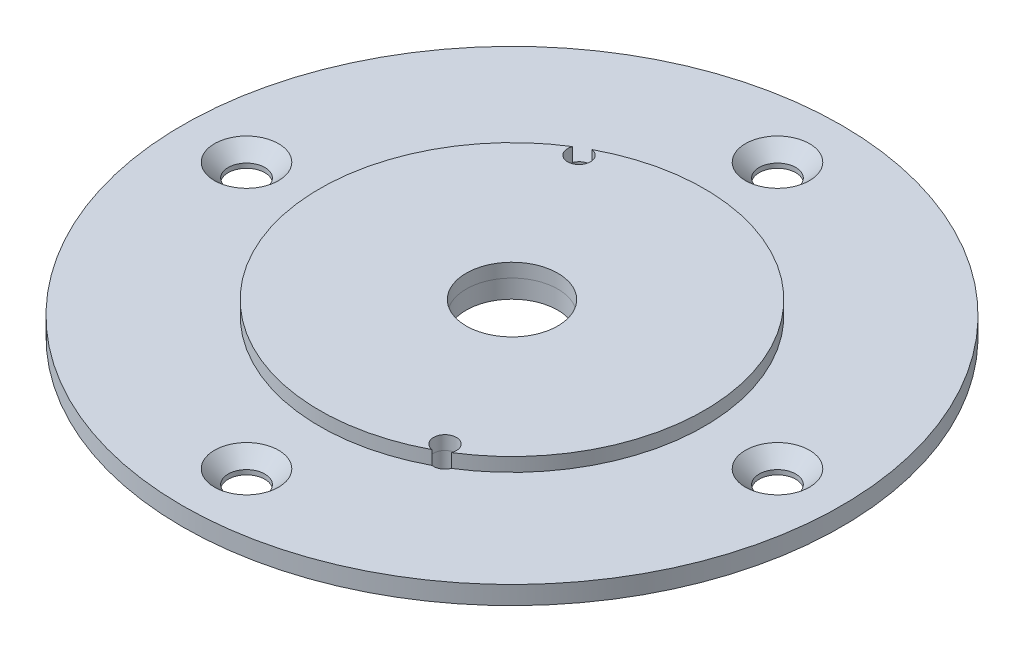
ISO-10303-21;
HEADER;
FILE_DESCRIPTION(('STEP AP214'),'2;1');
FILE_NAME('part.step','',(''),(''),'','','');
FILE_SCHEMA(('AUTOMOTIVE_DESIGN { 1 0 10303 214 1 1 1 1 }'));
ENDSEC;
DATA;
#1=APPLICATION_CONTEXT('core data for automotive mechanical design processes');
#2=APPLICATION_PROTOCOL_DEFINITION('international standard','automotive_design',2000,#1);
#3=PRODUCT_CONTEXT('',#1,'mechanical');
#4=PRODUCT('Part','Part','',(#3));
#5=PRODUCT_RELATED_PRODUCT_CATEGORY('part','',(#4));
#6=PRODUCT_DEFINITION_FORMATION('','',#4);
#7=PRODUCT_DEFINITION_CONTEXT('part definition',#1,'design');
#8=PRODUCT_DEFINITION('design','',#6,#7);
#9=PRODUCT_DEFINITION_SHAPE('','',#8);
#10=(LENGTH_UNIT() NAMED_UNIT(*) SI_UNIT(.MILLI.,.METRE.));
#11=(NAMED_UNIT(*) PLANE_ANGLE_UNIT() SI_UNIT($,.RADIAN.));
#12=(NAMED_UNIT(*) SI_UNIT($,.STERADIAN.) SOLID_ANGLE_UNIT());
#13=UNCERTAINTY_MEASURE_WITH_UNIT(LENGTH_MEASURE(1.E-05),#10,'distance_accuracy_value','');
#14=(GEOMETRIC_REPRESENTATION_CONTEXT(3) GLOBAL_UNCERTAINTY_ASSIGNED_CONTEXT((#13)) GLOBAL_UNIT_ASSIGNED_CONTEXT((#10,
#11,#12)) REPRESENTATION_CONTEXT('',''));
#15=CARTESIAN_POINT('',(0.,0.,0.));
#16=DIRECTION('',(0.,0.,1.));
#17=DIRECTION('',(1.,0.,0.));
#18=AXIS2_PLACEMENT_3D('',#15,#16,#17);
#19=CARTESIAN_POINT('',(4.99999999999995,2.5,8.66025403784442));
#20=DIRECTION('',(0.,1.,0.));
#21=DIRECTION('',(0.,0.,1.));
#22=AXIS2_PLACEMENT_3D('',#19,#20,#21);
#23=PLANE('',#22);
#24=CARTESIAN_POINT('',(9.99999999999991,2.5,17.3205080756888));
#25=DIRECTION('',(0.,-1.,0.));
#26=DIRECTION('',(0.,0.,1.));
#27=AXIS2_PLACEMENT_3D('',#24,#25,#26);
#28=CIRCLE('',#27,1.24999999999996);
#29=CARTESIAN_POINT('',(9.8275212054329,2.5,18.5585513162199));
#30=VERTEX_POINT('',#29);
#31=CARTESIAN_POINT('',(11.1584162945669,2.5,17.7901586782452));
#32=VERTEX_POINT('',#31);
#33=EDGE_CURVE('E103',#30,#32,#28,.T.);
#34=ORIENTED_EDGE('',*,*,#33,.T.);
#35=CARTESIAN_POINT('',(0.,2.5,0.));
#36=DIRECTION('',(0.,1.,0.));
#37=DIRECTION('',(0.,0.,1.));
#38=AXIS2_PLACEMENT_3D('',#35,#36,#37);
#39=CIRCLE('',#38,21.);
#40=CARTESIAN_POINT('',(-9.82752120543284,2.5,-18.5585513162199));
#41=VERTEX_POINT('',#40);
#42=EDGE_CURVE('E98',#32,#41,#39,.T.);
#43=ORIENTED_EDGE('',*,*,#42,.T.);
#44=CARTESIAN_POINT('',(-9.9999999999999,2.5,-17.3205080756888));
#45=DIRECTION('',(0.,-1.,0.));
#46=DIRECTION('',(0.,0.,1.));
#47=AXIS2_PLACEMENT_3D('',#44,#45,#46);
#48=CIRCLE('',#47,1.25);
#49=CARTESIAN_POINT('',(-11.1584162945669,2.5,-17.7901586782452));
#50=VERTEX_POINT('',#49);
#51=EDGE_CURVE('E101',#41,#50,#48,.T.);
#52=ORIENTED_EDGE('',*,*,#51,.T.);
#53=CARTESIAN_POINT('',(0.,2.5,0.));
#54=DIRECTION('',(0.,1.,0.));
#55=DIRECTION('',(0.,0.,1.));
#56=AXIS2_PLACEMENT_3D('',#53,#54,#55);
#57=CIRCLE('',#56,21.);
#58=EDGE_CURVE('E68',#50,#30,#57,.T.);
#59=ORIENTED_EDGE('',*,*,#58,.T.);
#60=EDGE_LOOP('',(#34,#43,#52,#59));
#61=FACE_BOUND('',#60,.T.);
#62=CARTESIAN_POINT('',(0.,2.5,0.));
#63=DIRECTION('',(0.,1.,0.));
#64=DIRECTION('',(0.,0.,1.));
#65=AXIS2_PLACEMENT_3D('',#62,#63,#64);
#66=CIRCLE('',#65,5.);
#67=CARTESIAN_POINT('',(0.,2.5,5.));
#68=VERTEX_POINT('',#67);
#69=EDGE_CURVE('E118',#68,#68,#66,.T.);
#70=ORIENTED_EDGE('',*,*,#69,.F.);
#71=EDGE_LOOP('',(#70));
#72=FACE_BOUND('',#71,.T.);
#73=ADVANCED_FACE('F51',(#61,#72),#23,.T.);
#74=CARTESIAN_POINT('',(4.99999999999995,1.,8.66025403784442));
#75=DIRECTION('',(0.,1.,0.));
#76=DIRECTION('',(0.,0.,1.));
#77=AXIS2_PLACEMENT_3D('',#74,#75,#76);
#78=PLANE('',#77);
#79=CARTESIAN_POINT('',(9.99999999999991,1.,17.3205080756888));
#80=DIRECTION('',(0.,-1.,0.));
#81=DIRECTION('',(0.,0.,1.));
#82=AXIS2_PLACEMENT_3D('',#79,#80,#81);
#83=CIRCLE('',#82,1.24999999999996);
#84=CARTESIAN_POINT('',(9.8275212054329,1.,18.5585513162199));
#85=VERTEX_POINT('',#84);
#86=CARTESIAN_POINT('',(11.1584162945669,1.,17.7901586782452));
#87=VERTEX_POINT('',#86);
#88=EDGE_CURVE('E115',#85,#87,#83,.T.);
#89=ORIENTED_EDGE('',*,*,#88,.F.);
#90=CARTESIAN_POINT('',(0.,1.,0.));
#91=DIRECTION('',(0.,1.,0.));
#92=DIRECTION('',(0.,0.,1.));
#93=AXIS2_PLACEMENT_3D('',#90,#91,#92);
#94=CIRCLE('',#93,21.);
#95=CARTESIAN_POINT('',(-11.1584162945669,1.,-17.7901586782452));
#96=VERTEX_POINT('',#95);
#97=EDGE_CURVE('E91',#96,#85,#94,.T.);
#98=ORIENTED_EDGE('',*,*,#97,.F.);
#99=CARTESIAN_POINT('',(-9.9999999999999,1.,-17.3205080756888));
#100=DIRECTION('',(0.,-1.,0.));
#101=DIRECTION('',(0.,0.,1.));
#102=AXIS2_PLACEMENT_3D('',#99,#100,#101);
#103=CIRCLE('',#102,1.25);
#104=CARTESIAN_POINT('',(-9.82752120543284,1.,-18.5585513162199));
#105=VERTEX_POINT('',#104);
#106=EDGE_CURVE('E85',#105,#96,#103,.T.);
#107=ORIENTED_EDGE('',*,*,#106,.F.);
#108=CARTESIAN_POINT('',(0.,1.,0.));
#109=DIRECTION('',(0.,1.,0.));
#110=DIRECTION('',(0.,0.,1.));
#111=AXIS2_PLACEMENT_3D('',#108,#109,#110);
#112=CIRCLE('',#111,21.);
#113=EDGE_CURVE('E107',#87,#105,#112,.T.);
#114=ORIENTED_EDGE('',*,*,#113,.F.);
#115=EDGE_LOOP('',(#89,#98,#107,#114));
#116=FACE_BOUND('',#115,.T.);
#117=CARTESIAN_POINT('',(0.,1.,0.));
#118=DIRECTION('',(0.,1.,0.));
#119=DIRECTION('',(0.,0.,1.));
#120=AXIS2_PLACEMENT_3D('',#117,#118,#119);
#121=CIRCLE('',#120,5.);
#122=CARTESIAN_POINT('',(0.,1.,5.));
#123=VERTEX_POINT('',#122);
#124=EDGE_CURVE('E130',#123,#123,#121,.T.);
#125=ORIENTED_EDGE('',*,*,#124,.T.);
#126=EDGE_LOOP('',(#125));
#127=FACE_BOUND('',#126,.T.);
#128=ADVANCED_FACE('F126',(#116,#127),#78,.F.);
#129=CARTESIAN_POINT('',(9.99999999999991,2.5,17.3205080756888));
#130=DIRECTION('',(0.,-1.,0.));
#131=DIRECTION('',(0.,0.,-1.));
#132=AXIS2_PLACEMENT_3D('',#129,#130,#131);
#133=CYLINDRICAL_SURFACE('',#132,1.24999999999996);
#134=ORIENTED_EDGE('',*,*,#88,.T.);
#135=DIRECTION('',(0.,-1.,0.));
#136=VECTOR('',#135,1.);
#137=CARTESIAN_POINT('',(11.1584162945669,2.5,17.7901586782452));
#138=LINE('',#137,#136);
#139=EDGE_CURVE('E12',#32,#87,#138,.T.);
#140=ORIENTED_EDGE('',*,*,#139,.F.);
#141=ORIENTED_EDGE('',*,*,#33,.F.);
#142=DIRECTION('',(0.,-1.,0.));
#143=VECTOR('',#142,1.);
#144=CARTESIAN_POINT('',(9.8275212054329,2.5,18.5585513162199));
#145=LINE('',#144,#143);
#146=EDGE_CURVE('E111',#30,#85,#145,.T.);
#147=ORIENTED_EDGE('',*,*,#146,.T.);
#148=EDGE_LOOP('',(#134,#140,#141,#147));
#149=FACE_BOUND('',#148,.T.);
#150=ADVANCED_FACE('F53',(#149),#133,.F.);
#151=CARTESIAN_POINT('',(0.,2.5,0.));
#152=DIRECTION('',(0.,-1.,0.));
#153=DIRECTION('',(0.,0.,-1.));
#154=AXIS2_PLACEMENT_3D('',#151,#152,#153);
#155=CYLINDRICAL_SURFACE('',#154,21.);
#156=ORIENTED_EDGE('',*,*,#113,.T.);
#157=DIRECTION('',(0.,-1.,0.));
#158=VECTOR('',#157,1.);
#159=CARTESIAN_POINT('',(-9.82752120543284,2.5,-18.5585513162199));
#160=LINE('',#159,#158);
#161=EDGE_CURVE('E60',#41,#105,#160,.T.);
#162=ORIENTED_EDGE('',*,*,#161,.F.);
#163=ORIENTED_EDGE('',*,*,#42,.F.);
#164=ORIENTED_EDGE('',*,*,#139,.T.);
#165=EDGE_LOOP('',(#156,#162,#163,#164));
#166=FACE_BOUND('',#165,.T.);
#167=ADVANCED_FACE('F106',(#166),#155,.T.);
#168=CARTESIAN_POINT('',(-9.9999999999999,2.5,-17.3205080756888));
#169=DIRECTION('',(0.,-1.,0.));
#170=DIRECTION('',(0.,0.,-1.));
#171=AXIS2_PLACEMENT_3D('',#168,#169,#170);
#172=CYLINDRICAL_SURFACE('',#171,1.25);
#173=ORIENTED_EDGE('',*,*,#106,.T.);
#174=DIRECTION('',(0.,-1.,0.));
#175=VECTOR('',#174,1.);
#176=CARTESIAN_POINT('',(-11.1584162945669,2.5,-17.7901586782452));
#177=LINE('',#176,#175);
#178=EDGE_CURVE('E108',#50,#96,#177,.T.);
#179=ORIENTED_EDGE('',*,*,#178,.F.);
#180=ORIENTED_EDGE('',*,*,#51,.F.);
#181=ORIENTED_EDGE('',*,*,#161,.T.);
#182=EDGE_LOOP('',(#173,#179,#180,#181));
#183=FACE_BOUND('',#182,.T.);
#184=ADVANCED_FACE('F109',(#183),#172,.F.);
#185=CARTESIAN_POINT('',(0.,2.5,0.));
#186=DIRECTION('',(0.,-1.,0.));
#187=DIRECTION('',(0.,0.,-1.));
#188=AXIS2_PLACEMENT_3D('',#185,#186,#187);
#189=CYLINDRICAL_SURFACE('',#188,21.);
#190=ORIENTED_EDGE('',*,*,#97,.T.);
#191=ORIENTED_EDGE('',*,*,#146,.F.);
#192=ORIENTED_EDGE('',*,*,#58,.F.);
#193=ORIENTED_EDGE('',*,*,#178,.T.);
#194=EDGE_LOOP('',(#190,#191,#192,#193));
#195=FACE_BOUND('',#194,.T.);
#196=ADVANCED_FACE('F123',(#195),#189,.T.);
#197=CARTESIAN_POINT('',(0.,2.5,0.));
#198=DIRECTION('',(0.,-1.,0.));
#199=DIRECTION('',(0.,0.,-1.));
#200=AXIS2_PLACEMENT_3D('',#197,#198,#199);
#201=CYLINDRICAL_SURFACE('',#200,5.);
#202=ORIENTED_EDGE('',*,*,#69,.T.);
#203=EDGE_LOOP('',(#202));
#204=FACE_BOUND('',#203,.T.);
#205=ORIENTED_EDGE('',*,*,#124,.F.);
#206=EDGE_LOOP('',(#205));
#207=FACE_BOUND('',#206,.T.);
#208=ADVANCED_FACE('F136',(#204,#207),#201,.F.);
#209=CLOSED_SHELL('',(#73,#128,#150,#167,#184,#196,#208));
#210=MANIFOLD_SOLID_BREP('B2',#209);
#211=CARTESIAN_POINT('',(0.,1.,0.));
#212=DIRECTION('',(0.,1.,0.));
#213=DIRECTION('',(0.,0.,1.));
#214=AXIS2_PLACEMENT_3D('',#211,#212,#213);
#215=PLANE('',#214);
#216=CARTESIAN_POINT('',(-9.9999999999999,1.,-17.3205080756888));
#217=DIRECTION('',(0.,1.,0.));
#218=DIRECTION('',(0.,0.,1.));
#219=AXIS2_PLACEMENT_3D('',#216,#217,#218);
#220=CIRCLE('',#219,1.25);
#221=CARTESIAN_POINT('',(-9.9999999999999,1.,-16.0705080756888));
#222=VERTEX_POINT('',#221);
#223=EDGE_CURVE('E275',#222,#222,#220,.T.);
#224=ORIENTED_EDGE('',*,*,#223,.F.);
#225=EDGE_LOOP('',(#224));
#226=FACE_BOUND('',#225,.T.);
#227=CARTESIAN_POINT('',(9.99999999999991,1.,17.3205080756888));
#228=DIRECTION('',(0.,1.,0.));
#229=DIRECTION('',(0.,0.,1.));
#230=AXIS2_PLACEMENT_3D('',#227,#228,#229);
#231=CIRCLE('',#230,1.25);
#232=CARTESIAN_POINT('',(9.99999999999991,1.,18.5705080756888));
#233=VERTEX_POINT('',#232);
#234=EDGE_CURVE('E269',#233,#233,#231,.T.);
#235=ORIENTED_EDGE('',*,*,#234,.F.);
#236=EDGE_LOOP('',(#235));
#237=FACE_BOUND('',#236,.T.);
#238=CARTESIAN_POINT('',(-29.,1.,0.));
#239=DIRECTION('',(0.,1.,0.));
#240=DIRECTION('',(0.,0.,1.));
#241=AXIS2_PLACEMENT_3D('',#238,#239,#240);
#242=CIRCLE('',#241,3.5);
#243=CARTESIAN_POINT('',(-29.,1.,3.5));
#244=VERTEX_POINT('',#243);
#245=EDGE_CURVE('E263',#244,#244,#242,.T.);
#246=ORIENTED_EDGE('',*,*,#245,.F.);
#247=EDGE_LOOP('',(#246));
#248=FACE_BOUND('',#247,.T.);
#249=CARTESIAN_POINT('',(29.,1.,0.));
#250=DIRECTION('',(0.,1.,0.));
#251=DIRECTION('',(0.,0.,1.));
#252=AXIS2_PLACEMENT_3D('',#249,#250,#251);
#253=CIRCLE('',#252,3.5);
#254=CARTESIAN_POINT('',(29.,1.,3.5));
#255=VERTEX_POINT('',#254);
#256=EDGE_CURVE('E254',#255,#255,#253,.T.);
#257=ORIENTED_EDGE('',*,*,#256,.F.);
#258=EDGE_LOOP('',(#257));
#259=FACE_BOUND('',#258,.T.);
#260=CARTESIAN_POINT('',(0.,1.,-29.));
#261=DIRECTION('',(0.,1.,0.));
#262=DIRECTION('',(0.,0.,1.));
#263=AXIS2_PLACEMENT_3D('',#260,#261,#262);
#264=CIRCLE('',#263,3.5);
#265=CARTESIAN_POINT('',(0.,1.,-25.5));
#266=VERTEX_POINT('',#265);
#267=EDGE_CURVE('E245',#266,#266,#264,.T.);
#268=ORIENTED_EDGE('',*,*,#267,.F.);
#269=EDGE_LOOP('',(#268));
#270=FACE_BOUND('',#269,.T.);
#271=CARTESIAN_POINT('',(0.,1.,29.));
#272=DIRECTION('',(0.,1.,0.));
#273=DIRECTION('',(0.,0.,1.));
#274=AXIS2_PLACEMENT_3D('',#271,#272,#273);
#275=CIRCLE('',#274,3.5);
#276=CARTESIAN_POINT('',(0.,1.,32.5));
#277=VERTEX_POINT('',#276);
#278=EDGE_CURVE('E236',#277,#277,#275,.T.);
#279=ORIENTED_EDGE('',*,*,#278,.F.);
#280=EDGE_LOOP('',(#279));
#281=FACE_BOUND('',#280,.T.);
#282=CARTESIAN_POINT('',(0.,1.,0.));
#283=DIRECTION('',(0.,1.,0.));
#284=DIRECTION('',(0.,0.,1.));
#285=AXIS2_PLACEMENT_3D('',#282,#283,#284);
#286=CIRCLE('',#285,36.);
#287=CARTESIAN_POINT('',(0.,1.,36.));
#288=VERTEX_POINT('',#287);
#289=EDGE_CURVE('E50',#288,#288,#286,.T.);
#290=ORIENTED_EDGE('',*,*,#289,.T.);
#291=EDGE_LOOP('',(#290));
#292=FACE_BOUND('',#291,.T.);
#293=CARTESIAN_POINT('',(0.,1.,0.));
#294=DIRECTION('',(0.,1.,0.));
#295=DIRECTION('',(0.,0.,1.));
#296=AXIS2_PLACEMENT_3D('',#293,#294,#295);
#297=CIRCLE('',#296,5.);
#298=CARTESIAN_POINT('',(0.,1.,5.));
#299=VERTEX_POINT('',#298);
#300=EDGE_CURVE('E223',#299,#299,#297,.T.);
#301=ORIENTED_EDGE('',*,*,#300,.F.);
#302=EDGE_LOOP('',(#301));
#303=FACE_BOUND('',#302,.T.);
#304=ADVANCED_FACE('F212',(#226,#237,#248,#259,#270,#281,#292,#303),#215,.T.);
#305=CARTESIAN_POINT('',(0.,-1.,0.));
#306=DIRECTION('',(0.,1.,0.));
#307=DIRECTION('',(0.,0.,1.));
#308=AXIS2_PLACEMENT_3D('',#305,#306,#307);
#309=PLANE('',#308);
#310=CARTESIAN_POINT('',(-9.9999999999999,-1.,-17.3205080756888));
#311=DIRECTION('',(0.,1.,0.));
#312=DIRECTION('',(0.,0.,1.));
#313=AXIS2_PLACEMENT_3D('',#310,#311,#312);
#314=CIRCLE('',#313,1.25);
#315=CARTESIAN_POINT('',(-9.9999999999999,-1.,-16.0705080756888));
#316=VERTEX_POINT('',#315);
#317=EDGE_CURVE('E272',#316,#316,#314,.T.);
#318=ORIENTED_EDGE('',*,*,#317,.T.);
#319=EDGE_LOOP('',(#318));
#320=FACE_BOUND('',#319,.T.);
#321=CARTESIAN_POINT('',(9.99999999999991,-1.,17.3205080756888));
#322=DIRECTION('',(0.,1.,0.));
#323=DIRECTION('',(0.,0.,1.));
#324=AXIS2_PLACEMENT_3D('',#321,#322,#323);
#325=CIRCLE('',#324,1.25);
#326=CARTESIAN_POINT('',(9.99999999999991,-1.,18.5705080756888));
#327=VERTEX_POINT('',#326);
#328=EDGE_CURVE('E266',#327,#327,#325,.T.);
#329=ORIENTED_EDGE('',*,*,#328,.T.);
#330=EDGE_LOOP('',(#329));
#331=FACE_BOUND('',#330,.T.);
#332=CARTESIAN_POINT('',(-29.,-1.,0.));
#333=DIRECTION('',(0.,1.,0.));
#334=DIRECTION('',(0.,0.,1.));
#335=AXIS2_PLACEMENT_3D('',#332,#333,#334);
#336=CIRCLE('',#335,2.);
#337=CARTESIAN_POINT('',(-29.,-1.,2.));
#338=VERTEX_POINT('',#337);
#339=EDGE_CURVE('E257',#338,#338,#336,.T.);
#340=ORIENTED_EDGE('',*,*,#339,.T.);
#341=EDGE_LOOP('',(#340));
#342=FACE_BOUND('',#341,.T.);
#343=CARTESIAN_POINT('',(29.,-1.,0.));
#344=DIRECTION('',(0.,1.,0.));
#345=DIRECTION('',(0.,0.,1.));
#346=AXIS2_PLACEMENT_3D('',#343,#344,#345);
#347=CIRCLE('',#346,2.);
#348=CARTESIAN_POINT('',(29.,-1.,2.));
#349=VERTEX_POINT('',#348);
#350=EDGE_CURVE('E248',#349,#349,#347,.T.);
#351=ORIENTED_EDGE('',*,*,#350,.T.);
#352=EDGE_LOOP('',(#351));
#353=FACE_BOUND('',#352,.T.);
#354=CARTESIAN_POINT('',(0.,-1.,-29.));
#355=DIRECTION('',(0.,1.,0.));
#356=DIRECTION('',(0.,0.,1.));
#357=AXIS2_PLACEMENT_3D('',#354,#355,#356);
#358=CIRCLE('',#357,2.);
#359=CARTESIAN_POINT('',(0.,-1.,-27.));
#360=VERTEX_POINT('',#359);
#361=EDGE_CURVE('E239',#360,#360,#358,.T.);
#362=ORIENTED_EDGE('',*,*,#361,.T.);
#363=EDGE_LOOP('',(#362));
#364=FACE_BOUND('',#363,.T.);
#365=CARTESIAN_POINT('',(0.,-1.,29.));
#366=DIRECTION('',(0.,1.,0.));
#367=DIRECTION('',(0.,0.,1.));
#368=AXIS2_PLACEMENT_3D('',#365,#366,#367);
#369=CIRCLE('',#368,2.);
#370=CARTESIAN_POINT('',(0.,-1.,31.));
#371=VERTEX_POINT('',#370);
#372=EDGE_CURVE('E228',#371,#371,#369,.T.);
#373=ORIENTED_EDGE('',*,*,#372,.T.);
#374=EDGE_LOOP('',(#373));
#375=FACE_BOUND('',#374,.T.);
#376=CARTESIAN_POINT('',(0.,-1.,0.));
#377=DIRECTION('',(0.,1.,0.));
#378=DIRECTION('',(0.,0.,1.));
#379=AXIS2_PLACEMENT_3D('',#376,#377,#378);
#380=CIRCLE('',#379,36.);
#381=CARTESIAN_POINT('',(0.,-1.,36.));
#382=VERTEX_POINT('',#381);
#383=EDGE_CURVE('E216',#382,#382,#380,.T.);
#384=ORIENTED_EDGE('',*,*,#383,.F.);
#385=EDGE_LOOP('',(#384));
#386=FACE_BOUND('',#385,.T.);
#387=CARTESIAN_POINT('',(0.,-1.,0.));
#388=DIRECTION('',(0.,1.,0.));
#389=DIRECTION('',(0.,0.,1.));
#390=AXIS2_PLACEMENT_3D('',#387,#388,#389);
#391=CIRCLE('',#390,5.);
#392=CARTESIAN_POINT('',(0.,-1.,5.));
#393=VERTEX_POINT('',#392);
#394=EDGE_CURVE('E225',#393,#393,#391,.T.);
#395=ORIENTED_EDGE('',*,*,#394,.T.);
#396=EDGE_LOOP('',(#395));
#397=FACE_BOUND('',#396,.T.);
#398=ADVANCED_FACE('F283',(#320,#331,#342,#353,#364,#375,#386,#397),#309,.F.);
#399=CARTESIAN_POINT('',(0.,1.,0.));
#400=DIRECTION('',(0.,-1.,0.));
#401=DIRECTION('',(0.,0.,-1.));
#402=AXIS2_PLACEMENT_3D('',#399,#400,#401);
#403=CYLINDRICAL_SURFACE('',#402,36.);
#404=ORIENTED_EDGE('',*,*,#289,.F.);
#405=EDGE_LOOP('',(#404));
#406=FACE_BOUND('',#405,.T.);
#407=ORIENTED_EDGE('',*,*,#383,.T.);
#408=EDGE_LOOP('',(#407));
#409=FACE_BOUND('',#408,.T.);
#410=ADVANCED_FACE('F214',(#406,#409),#403,.T.);
#411=CARTESIAN_POINT('',(0.,1.,0.));
#412=DIRECTION('',(0.,-1.,0.));
#413=DIRECTION('',(0.,0.,-1.));
#414=AXIS2_PLACEMENT_3D('',#411,#412,#413);
#415=CYLINDRICAL_SURFACE('',#414,5.);
#416=ORIENTED_EDGE('',*,*,#300,.T.);
#417=EDGE_LOOP('',(#416));
#418=FACE_BOUND('',#417,.T.);
#419=ORIENTED_EDGE('',*,*,#394,.F.);
#420=EDGE_LOOP('',(#419));
#421=FACE_BOUND('',#420,.T.);
#422=ADVANCED_FACE('F297',(#418,#421),#415,.F.);
#423=CARTESIAN_POINT('',(0.,1.,29.));
#424=DIRECTION('',(0.,1.,0.));
#425=DIRECTION('',(0.,0.,1.));
#426=AXIS2_PLACEMENT_3D('',#423,#424,#425);
#427=CYLINDRICAL_SURFACE('',#426,2.);
#428=ORIENTED_EDGE('',*,*,#372,.F.);
#429=EDGE_LOOP('',(#428));
#430=FACE_BOUND('',#429,.T.);
#431=CARTESIAN_POINT('',(0.,-0.499999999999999,29.));
#432=DIRECTION('',(0.,1.,0.));
#433=DIRECTION('',(0.,0.,1.));
#434=AXIS2_PLACEMENT_3D('',#431,#432,#433);
#435=CIRCLE('',#434,2.);
#436=CARTESIAN_POINT('',(0.,-0.499999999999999,31.));
#437=VERTEX_POINT('',#436);
#438=EDGE_CURVE('E233',#437,#437,#435,.T.);
#439=ORIENTED_EDGE('',*,*,#438,.T.);
#440=EDGE_LOOP('',(#439));
#441=FACE_BOUND('',#440,.T.);
#442=ADVANCED_FACE('F300',(#430,#441),#427,.F.);
#443=CARTESIAN_POINT('',(0.,1.,29.));
#444=DIRECTION('',(0.,1.,0.));
#445=DIRECTION('',(0.,0.,1.));
#446=AXIS2_PLACEMENT_3D('',#443,#444,#445);
#447=CONICAL_SURFACE('',#446,3.5,0.785398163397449);
#448=ORIENTED_EDGE('',*,*,#438,.F.);
#449=EDGE_LOOP('',(#448));
#450=FACE_BOUND('',#449,.T.);
#451=ORIENTED_EDGE('',*,*,#278,.T.);
#452=EDGE_LOOP('',(#451));
#453=FACE_BOUND('',#452,.T.);
#454=ADVANCED_FACE('F314',(#450,#453),#447,.F.);
#455=CARTESIAN_POINT('',(0.,1.,-29.));
#456=DIRECTION('',(0.,1.,0.));
#457=DIRECTION('',(0.,0.,1.));
#458=AXIS2_PLACEMENT_3D('',#455,#456,#457);
#459=CYLINDRICAL_SURFACE('',#458,2.);
#460=ORIENTED_EDGE('',*,*,#361,.F.);
#461=EDGE_LOOP('',(#460));
#462=FACE_BOUND('',#461,.T.);
#463=CARTESIAN_POINT('',(0.,-0.499999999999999,-29.));
#464=DIRECTION('',(0.,1.,0.));
#465=DIRECTION('',(0.,0.,1.));
#466=AXIS2_PLACEMENT_3D('',#463,#464,#465);
#467=CIRCLE('',#466,2.);
#468=CARTESIAN_POINT('',(0.,-0.499999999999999,-27.));
#469=VERTEX_POINT('',#468);
#470=EDGE_CURVE('E242',#469,#469,#467,.T.);
#471=ORIENTED_EDGE('',*,*,#470,.T.);
#472=EDGE_LOOP('',(#471));
#473=FACE_BOUND('',#472,.T.);
#474=ADVANCED_FACE('F318',(#462,#473),#459,.F.);
#475=CARTESIAN_POINT('',(0.,1.,-29.));
#476=DIRECTION('',(0.,1.,0.));
#477=DIRECTION('',(0.,0.,1.));
#478=AXIS2_PLACEMENT_3D('',#475,#476,#477);
#479=CONICAL_SURFACE('',#478,3.5,0.785398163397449);
#480=ORIENTED_EDGE('',*,*,#470,.F.);
#481=EDGE_LOOP('',(#480));
#482=FACE_BOUND('',#481,.T.);
#483=ORIENTED_EDGE('',*,*,#267,.T.);
#484=EDGE_LOOP('',(#483));
#485=FACE_BOUND('',#484,.T.);
#486=ADVANCED_FACE('F322',(#482,#485),#479,.F.);
#487=CARTESIAN_POINT('',(29.,1.,0.));
#488=DIRECTION('',(0.,1.,0.));
#489=DIRECTION('',(0.,0.,1.));
#490=AXIS2_PLACEMENT_3D('',#487,#488,#489);
#491=CYLINDRICAL_SURFACE('',#490,2.);
#492=ORIENTED_EDGE('',*,*,#350,.F.);
#493=EDGE_LOOP('',(#492));
#494=FACE_BOUND('',#493,.T.);
#495=CARTESIAN_POINT('',(29.,-0.499999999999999,0.));
#496=DIRECTION('',(0.,1.,0.));
#497=DIRECTION('',(0.,0.,1.));
#498=AXIS2_PLACEMENT_3D('',#495,#496,#497);
#499=CIRCLE('',#498,2.);
#500=CARTESIAN_POINT('',(29.,-0.499999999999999,2.));
#501=VERTEX_POINT('',#500);
#502=EDGE_CURVE('E251',#501,#501,#499,.T.);
#503=ORIENTED_EDGE('',*,*,#502,.T.);
#504=EDGE_LOOP('',(#503));
#505=FACE_BOUND('',#504,.T.);
#506=ADVANCED_FACE('F326',(#494,#505),#491,.F.);
#507=CARTESIAN_POINT('',(29.,1.,0.));
#508=DIRECTION('',(0.,1.,0.));
#509=DIRECTION('',(0.,0.,1.));
#510=AXIS2_PLACEMENT_3D('',#507,#508,#509);
#511=CONICAL_SURFACE('',#510,3.5,0.785398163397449);
#512=ORIENTED_EDGE('',*,*,#502,.F.);
#513=EDGE_LOOP('',(#512));
#514=FACE_BOUND('',#513,.T.);
#515=ORIENTED_EDGE('',*,*,#256,.T.);
#516=EDGE_LOOP('',(#515));
#517=FACE_BOUND('',#516,.T.);
#518=ADVANCED_FACE('F330',(#514,#517),#511,.F.);
#519=CARTESIAN_POINT('',(-29.,1.,0.));
#520=DIRECTION('',(0.,1.,0.));
#521=DIRECTION('',(0.,0.,1.));
#522=AXIS2_PLACEMENT_3D('',#519,#520,#521);
#523=CYLINDRICAL_SURFACE('',#522,2.);
#524=ORIENTED_EDGE('',*,*,#339,.F.);
#525=EDGE_LOOP('',(#524));
#526=FACE_BOUND('',#525,.T.);
#527=CARTESIAN_POINT('',(-29.,-0.499999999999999,0.));
#528=DIRECTION('',(0.,1.,0.));
#529=DIRECTION('',(0.,0.,1.));
#530=AXIS2_PLACEMENT_3D('',#527,#528,#529);
#531=CIRCLE('',#530,2.);
#532=CARTESIAN_POINT('',(-29.,-0.499999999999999,2.));
#533=VERTEX_POINT('',#532);
#534=EDGE_CURVE('E260',#533,#533,#531,.T.);
#535=ORIENTED_EDGE('',*,*,#534,.T.);
#536=EDGE_LOOP('',(#535));
#537=FACE_BOUND('',#536,.T.);
#538=ADVANCED_FACE('F334',(#526,#537),#523,.F.);
#539=CARTESIAN_POINT('',(-29.,1.,0.));
#540=DIRECTION('',(0.,1.,0.));
#541=DIRECTION('',(0.,0.,1.));
#542=AXIS2_PLACEMENT_3D('',#539,#540,#541);
#543=CONICAL_SURFACE('',#542,3.5,0.785398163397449);
#544=ORIENTED_EDGE('',*,*,#534,.F.);
#545=EDGE_LOOP('',(#544));
#546=FACE_BOUND('',#545,.T.);
#547=ORIENTED_EDGE('',*,*,#245,.T.);
#548=EDGE_LOOP('',(#547));
#549=FACE_BOUND('',#548,.T.);
#550=ADVANCED_FACE('F338',(#546,#549),#543,.F.);
#551=CARTESIAN_POINT('',(9.99999999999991,1.,17.3205080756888));
#552=DIRECTION('',(0.,1.,0.));
#553=DIRECTION('',(0.,0.,1.));
#554=AXIS2_PLACEMENT_3D('',#551,#552,#553);
#555=CYLINDRICAL_SURFACE('',#554,1.25);
#556=ORIENTED_EDGE('',*,*,#328,.F.);
#557=EDGE_LOOP('',(#556));
#558=FACE_BOUND('',#557,.T.);
#559=ORIENTED_EDGE('',*,*,#234,.T.);
#560=EDGE_LOOP('',(#559));
#561=FACE_BOUND('',#560,.T.);
#562=ADVANCED_FACE('F342',(#558,#561),#555,.F.);
#563=CARTESIAN_POINT('',(-9.9999999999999,1.,-17.3205080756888));
#564=DIRECTION('',(0.,1.,0.));
#565=DIRECTION('',(0.,0.,1.));
#566=AXIS2_PLACEMENT_3D('',#563,#564,#565);
#567=CYLINDRICAL_SURFACE('',#566,1.25);
#568=ORIENTED_EDGE('',*,*,#317,.F.);
#569=EDGE_LOOP('',(#568));
#570=FACE_BOUND('',#569,.T.);
#571=ORIENTED_EDGE('',*,*,#223,.T.);
#572=EDGE_LOOP('',(#571));
#573=FACE_BOUND('',#572,.T.);
#574=ADVANCED_FACE('F279',(#570,#573),#567,.F.);
#575=CLOSED_SHELL('',(#304,#398,#410,#422,#442,#454,#474,#486,#506,#518,#538,#550,#562,#574));
#576=MANIFOLD_SOLID_BREP('B6',#575);
#577=ADVANCED_BREP_SHAPE_REPRESENTATION('',(#18,#210,#576),#14);
#578=SHAPE_DEFINITION_REPRESENTATION(#9,#577);
ENDSEC;
END-ISO-10303-21;
